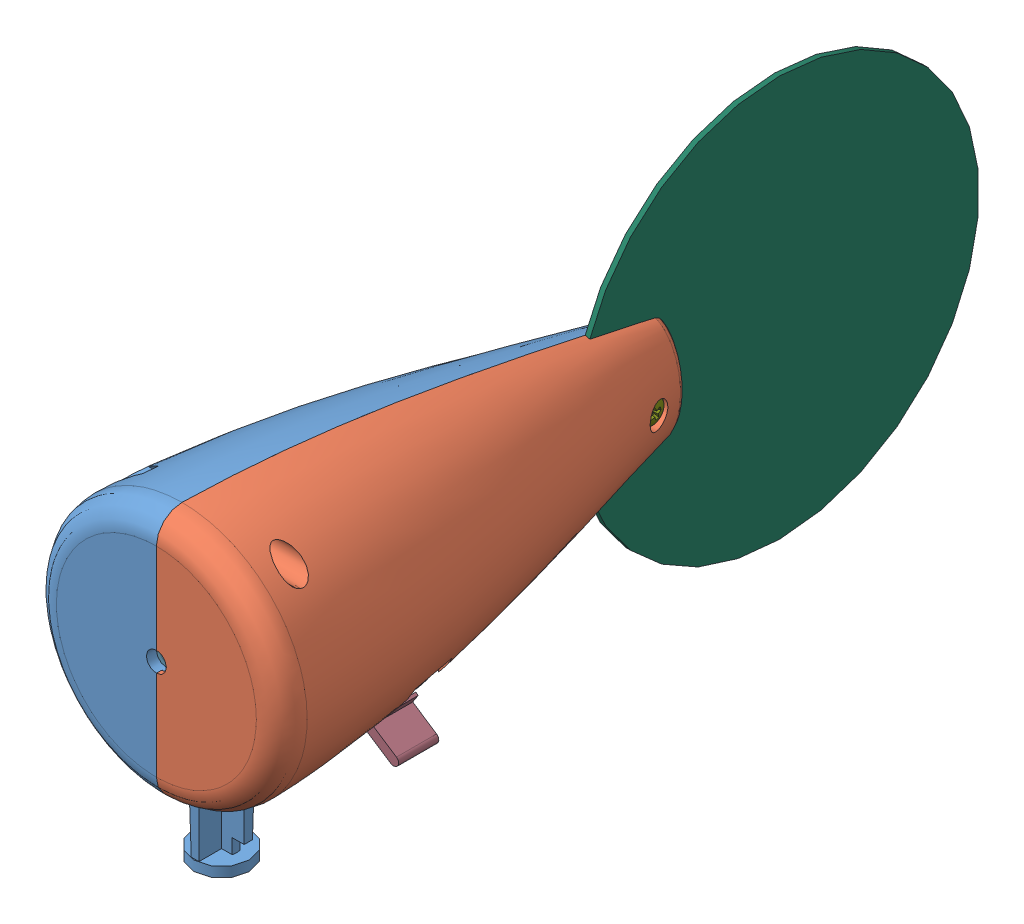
SolidWorks assembly Bloc-Corps.SLDASM, configuration Défaut (file format 4400). Lengths in mm.
Overall size (52.98 80 163.01).
68 component instances, 17 part files, 22 mates.
Components (placement in the parent):
- Carter-gauche-1: Carter-gauche.SLDPRT [Défaut] at origin size (32.84 66.36 100.12)
- Carter-droit-1: Carter-droit.SLDPRT [Défaut] at origin size (28.34 53.31 100.12)
- Circuit-Redresseur-1: Circuit-Redresseur.SLDASM [Défaut] at (0 -9.75 -71.85) x (0 0 1) z (-1 0 0) size (51.6 25.74 31)
  - Circuit-1: Circuit.SLDPRT [Défaut] at origin size (51.6 1.3 29.8)
  - User Library-jst-b3b-xh-a-1: User Library-jst-b3b-xh-a.SLDPRT [Default] at (47.225 1.3 6.95) x (0 0 1) z (-1 0 0) size (9.9 10.4 5.75)
  - User Library-DO-35_300mils-1: User Library-DO-35_300mils.SLDASM [Default] at (30.5184 1.5 -4.9268) x (1 0 0) z (0 1 0) size (8.16 1.92 4.46)
    - User Library-DO-35_300mils_Cylinder001-1: User Library-DO-35_300mils_Cylinder001.sldprt [Default] at origin size (1 0.52 0.52)
    - User Library-DO-35_300mils_Cylinder002-1: User Library-DO-35_300mils_Cylinder002.sldprt [Default] at origin size (1 0.52 0.52)
    - User Library-DO-35_300mils_Torus-1: User Library-DO-35_300mils_Torus.sldprt [Default] at origin size (0.77 0.55 0.77)
    - User Library-DO-35_300mils_Cylinder003-1: User Library-DO-35_300mils_Cylinder003.sldprt [Default] at origin size (0.52 0.52 3)
    - User Library-DO-35_300mils_Cylinder004-1: User Library-DO-35_300mils_Cylinder004.sldprt [Default] at origin size (0.52 0.52 3)
    - User Library-DO-35_300mils_Torus_(Mirror_#1)-1: User Library-DO-35_300mils_Torus_(Mirror_#1).sldprt [Default] at origin size (0.77 0.55 0.77)
    - User Library-DO-35_300mils_Fillet-1: User Library-DO-35_300mils_Fillet.sldprt [Default] at origin size (4.32 1.92 1.92)
    - User Library-DO-35_300mils_Fillet001-1: User Library-DO-35_300mils_Fillet001.sldprt [Default] at origin size (0.7 1.92 1.92)
  - User Library-DO-35_300mils-2: User Library-DO-35_300mils.SLDASM [Default] at (30.5184 1.5 6.821) x (1 0 0) z (0 1 0) size (8.16 1.92 4.46)
    - User Library-DO-35_300mils_Cylinder001-1: User Library-DO-35_300mils_Cylinder001.sldprt [Default] at origin size (1 0.52 0.52)
    - User Library-DO-35_300mils_Cylinder002-1: User Library-DO-35_300mils_Cylinder002.sldprt [Default] at origin size (1 0.52 0.52)
    - User Library-DO-35_300mils_Torus-1: User Library-DO-35_300mils_Torus.sldprt [Default] at origin size (0.77 0.55 0.77)
    - User Library-DO-35_300mils_Cylinder003-1: User Library-DO-35_300mils_Cylinder003.sldprt [Default] at origin size (0.52 0.52 3)
    - User Library-DO-35_300mils_Cylinder004-1: User Library-DO-35_300mils_Cylinder004.sldprt [Default] at origin size (0.52 0.52 3)
    - User Library-DO-35_300mils_Torus_(Mirror_#1)-1: User Library-DO-35_300mils_Torus_(Mirror_#1).sldprt [Default] at origin size (0.77 0.55 0.77)
    - User Library-DO-35_300mils_Fillet-1: User Library-DO-35_300mils_Fillet.sldprt [Default] at origin size (4.32 1.92 1.92)
    - User Library-DO-35_300mils_Fillet001-1: User Library-DO-35_300mils_Fillet001.sldprt [Default] at origin size (0.7 1.92 1.92)
  - User Library-DO-35_300mils-3: User Library-DO-35_300mils.SLDASM [Default] at (30.5184 1.5 9.741) x (1 0 0) z (0 1 0) size (8.16 1.92 4.46)
    - User Library-DO-35_300mils_Cylinder001-1: User Library-DO-35_300mils_Cylinder001.sldprt [Default] at origin size (1 0.52 0.52)
    - User Library-DO-35_300mils_Cylinder002-1: User Library-DO-35_300mils_Cylinder002.sldprt [Default] at origin size (1 0.52 0.52)
    - User Library-DO-35_300mils_Torus-1: User Library-DO-35_300mils_Torus.sldprt [Default] at origin size (0.77 0.55 0.77)
    - User Library-DO-35_300mils_Cylinder003-1: User Library-DO-35_300mils_Cylinder003.sldprt [Default] at origin size (0.52 0.52 3)
    - User Library-DO-35_300mils_Cylinder004-1: User Library-DO-35_300mils_Cylinder004.sldprt [Default] at origin size (0.52 0.52 3)
    - User Library-DO-35_300mils_Torus_(Mirror_#1)-1: User Library-DO-35_300mils_Torus_(Mirror_#1).sldprt [Default] at origin size (0.77 0.55 0.77)
    - User Library-DO-35_300mils_Fillet-1: User Library-DO-35_300mils_Fillet.sldprt [Default] at origin size (4.32 1.92 1.92)
    - User Library-DO-35_300mils_Fillet001-1: User Library-DO-35_300mils_Fillet001.sldprt [Default] at origin size (0.7 1.92 1.92)
  - User Library-DO-35_300mils-4: User Library-DO-35_300mils.SLDASM [Default] at (30.5184 1.5 -7.8468) x (1 0 0) z (0 1 0) size (8.16 1.92 4.46)
    - User Library-DO-35_300mils_Cylinder001-1: User Library-DO-35_300mils_Cylinder001.sldprt [Default] at origin size (1 0.52 0.52)
    - User Library-DO-35_300mils_Cylinder002-1: User Library-DO-35_300mils_Cylinder002.sldprt [Default] at origin size (1 0.52 0.52)
    - User Library-DO-35_300mils_Torus-1: User Library-DO-35_300mils_Torus.sldprt [Default] at origin size (0.77 0.55 0.77)
    - User Library-DO-35_300mils_Cylinder003-1: User Library-DO-35_300mils_Cylinder003.sldprt [Default] at origin size (0.52 0.52 3)
    - User Library-DO-35_300mils_Cylinder004-1: User Library-DO-35_300mils_Cylinder004.sldprt [Default] at origin size (0.52 0.52 3)
    - User Library-DO-35_300mils_Torus_(Mirror_#1)-1: User Library-DO-35_300mils_Torus_(Mirror_#1).sldprt [Default] at origin size (0.77 0.55 0.77)
    - User Library-DO-35_300mils_Fillet-1: User Library-DO-35_300mils_Fillet.sldprt [Default] at origin size (4.32 1.92 1.92)
    - User Library-DO-35_300mils_Fillet001-1: User Library-DO-35_300mils_Fillet001.sldprt [Default] at origin size (0.7 1.92 1.92)
  - User Library-DO-35_300mils-5: User Library-DO-35_300mils.SLDASM [Default] at (30.5184 1.5 -2.0068) x (1 0 0) z (0 1 0) size (8.16 1.92 4.46)
    - User Library-DO-35_300mils_Cylinder001-1: User Library-DO-35_300mils_Cylinder001.sldprt [Default] at origin size (1 0.52 0.52)
    - User Library-DO-35_300mils_Cylinder002-1: User Library-DO-35_300mils_Cylinder002.sldprt [Default] at origin size (1 0.52 0.52)
    - User Library-DO-35_300mils_Torus-1: User Library-DO-35_300mils_Torus.sldprt [Default] at origin size (0.77 0.55 0.77)
    - User Library-DO-35_300mils_Cylinder003-1: User Library-DO-35_300mils_Cylinder003.sldprt [Default] at origin size (0.52 0.52 3)
    - User Library-DO-35_300mils_Cylinder004-1: User Library-DO-35_300mils_Cylinder004.sldprt [Default] at origin size (0.52 0.52 3)
    - User Library-DO-35_300mils_Torus_(Mirror_#1)-1: User Library-DO-35_300mils_Torus_(Mirror_#1).sldprt [Default] at origin size (0.77 0.55 0.77)
    - User Library-DO-35_300mils_Fillet-1: User Library-DO-35_300mils_Fillet.sldprt [Default] at origin size (4.32 1.92 1.92)
    - User Library-DO-35_300mils_Fillet001-1: User Library-DO-35_300mils_Fillet001.sldprt [Default] at origin size (0.7 1.92 1.92)
  - User Library-DO-35_300mils-6: User Library-DO-35_300mils.SLDASM [Default] at (46.0064 1.5 -11.2646) x (0 0 1) z (0 1 0) size (8.16 1.92 4.46)
    - User Library-DO-35_300mils_Cylinder001-1: User Library-DO-35_300mils_Cylinder001.sldprt [Default] at origin size (1 0.52 0.52)
    - User Library-DO-35_300mils_Cylinder002-1: User Library-DO-35_300mils_Cylinder002.sldprt [Default] at origin size (1 0.52 0.52)
    - User Library-DO-35_300mils_Torus-1: User Library-DO-35_300mils_Torus.sldprt [Default] at origin size (0.77 0.55 0.77)
    - User Library-DO-35_300mils_Cylinder003-1: User Library-DO-35_300mils_Cylinder003.sldprt [Default] at origin size (0.52 0.52 3)
    - User Library-DO-35_300mils_Cylinder004-1: User Library-DO-35_300mils_Cylinder004.sldprt [Default] at origin size (0.52 0.52 3)
    - User Library-DO-35_300mils_Torus_(Mirror_#1)-1: User Library-DO-35_300mils_Torus_(Mirror_#1).sldprt [Default] at origin size (0.77 0.55 0.77)
    - User Library-DO-35_300mils_Fillet-1: User Library-DO-35_300mils_Fillet.sldprt [Default] at origin size (4.32 1.92 1.92)
    - User Library-DO-35_300mils_Fillet001-1: User Library-DO-35_300mils_Fillet001.sldprt [Default] at origin size (0.7 1.92 1.92)
  - Cosse-1: Cosse.SLDPRT [Défaut] at (35.0403 0 0) x (0 0 -1) z (-1 0 0) size (31 23.94 11.8)
- Stator-1: Stator.SLDPRT [Défaut] at (0 0 -4.9) size (30 30 13.2)
- Enpennage-1: Enpennage.SLDPRT [Défaut] at (1 0 -123) x (0 0 1) z (-1 0 0) size (80 80 1.1)
- Vis M2.5x10-1: Vis M2.5x10.SLDPRT [B18.6.7M - M2.5 x 0.45 x 10 Type I Cross Recessed PHMS --10N] at (5.1 19 -11) x (-1 0 0) z (0 -0.924225 -0.381849) size (12.07 5 5)
- Vis M2.5x10-2: Vis M2.5x10.SLDPRT [B18.6.7M - M2.5 x 0.45 x 10 Type I Cross Recessed PHMS --10N] at (7.1 0 -92.5) x (-1 0 0) z (0 -0.924225 -0.381849) size (12.07 5 5)
- Vis M2.5x10-3: Vis M2.5x10.SLDPRT [B18.6.7M - M2.5 x 0.45 x 10 Type I Cross Recessed PHMS --10N] at (5.1 -19 -11) x (-1 0 0) z (0 -0.924225 -0.381849) size (12.07 5 5)
- Ecrou M2.5-1: Ecrou M2.5.SLDPRT [B18.2.4.1M - Hex nut, Style 1,  M2.5 x 0.45 --D-N] at (-4 19 -11) x (0 -0.5 0.866025) z (-1 0 0) size (5 5.77 2)
- Ecrou M2.5-2: Ecrou M2.5.SLDPRT [B18.2.4.1M - Hex nut, Style 1,  M2.5 x 0.45 --D-N] at (-4 -19 -11) x (0 -0.464539 0.885553) z (-1 0 0) size (5 5.77 2)
- Ecrou M2.5-3: Ecrou M2.5.SLDPRT [B18.2.4.1M - Hex nut, Style 1,  M2.5 x 0.45 --D-N] at (-1 0 -92.5) x (0 -0.278621 0.960401) z (-1 0 0) size (5 5.77 2)
Mates (geometry in assembly coordinates):
- Coïncidente2: coincident anti-aligned: plane of Carter-gauche-1 through (-26.3426 -8.25 -47.55) normal (0 0 1); plane of Circuit-Redresseur-1/Circuit-1 through (-13.4867 -8.45 -47.55) normal (0 0 -1)
- Coïncidente3: coincident anti-aligned: plane of Carter-gauche-1 through (-26.3426 -9.75 -45.8) normal (0 1 0); plane of Circuit-Redresseur-1/Circuit-1 through (-14.9 -9.75 -21.75) normal (0 -1 0)
- Coïncidente4: coincident anti-aligned: plane of Carter-gauche-1 through (-9.5 -11 -20.5) normal (1 0 0); plane of Circuit-Redresseur-1/Circuit-1 through (-9.5 -8.45 -21.75) normal (-1 0 0)
- Coïncidente5: coincident anti-aligned: plane of Carter-gauche-1 through (-26.3426 -15 -4.9) normal (0 1 0); plane of Stator-1 through (-12.5 -15 -5.9) normal (0 -1 0)
- Coïncidente6: coincident anti-aligned: plane of Carter-gauche-1 through (-15 -8.5 -4.9) normal (1 0 0); plane of Stator-1 through (-15 12.5 -5.9) normal (-1 0 0)
- Coïncidente7: coincident anti-aligned: plane of Carter-gauche-1 through (-26.3426 -8.5 -4.9) normal (0 0 -1); plane of Stator-1 through (0 0 -4.9) normal (0 0 1)
- Coaxiale1: concentric anti-aligned: cylinder of Carter-gauche-1 through (-26.3416 0 -92.5) axis (1 0 0) radius 1.5; cylinder of Enpennage-1 through (1 0 -92.5) axis (-1 0 0) radius 3
- Coïncidente8: coincident anti-aligned: plane of Carter-gauche-1 through (0 25 0) normal (1 0 0); plane of Enpennage-1 through (0 0 -123) normal (-1 0 0)
- Coaxiale2: concentric anti-aligned: cylinder of Carter-droit-1 through (26.6354 19 -11) axis (-1 0 0) radius 2.5; cylinder of Vis M2.5x10-1 through (30.5 19 -11) axis (1 0 0) radius 1.25
- Coaxiale3: concentric anti-aligned: cylinder of Carter-droit-1 through (26.6354 0 -92.5) axis (-1 0 0) radius 2.5; cylinder of Vis M2.5x10-2 through (32.5 0 -92.5) axis (1 0 0) radius 1.25
- Coaxiale4: concentric anti-aligned: cylinder of Carter-droit-1 through (26.6354 -19 -11) axis (-1 0 0) radius 2.5; cylinder of Vis M2.5x10-3 through (30.5 -19 -11) axis (1 0 0) radius 1.25
- Coïncidente9: coincident anti-aligned: plane of Carter-droit-1 through (3 19 -11) normal (1 0 0); plane of Vis M2.5x10-1 through (3 19.4773 -12.1553) normal (-1 0 0)
- Coïncidente10: coincident anti-aligned: plane of Carter-droit-1 through (5 0 -92.5) normal (1 0 0); plane of Vis M2.5x10-2 through (5 0.4773 -93.6553) normal (-1 0 0)
- Coïncidente11: coincident anti-aligned: plane of Carter-droit-1 through (3 -19 -11) normal (1 0 0); plane of Vis M2.5x10-3 through (3 -18.5227 -12.1553) normal (-1 0 0)
- Coaxiale5: concentric anti-aligned: cylinder of Vis M2.5x10-1 through (30.5 19 -11) axis (1 0 0) radius 1.25; cylinder of Ecrou M2.5-1 through (-2 19 -11) axis (-1 0 0) radius 1.025
- Coaxiale6: concentric anti-aligned: cylinder of Vis M2.5x10-3 through (30.5 -19 -11) axis (1 0 0) radius 1.25; cylinder of Ecrou M2.5-2 through (-2 -19 -11) axis (-1 0 0) radius 1.025
- Coaxiale7: concentric anti-aligned: cylinder of Vis M2.5x10-2 through (32.5 0 -92.5) axis (1 0 0) radius 1.25; cylinder of Ecrou M2.5-3 through (1 0 -92.5) axis (-1 0 0) radius 1.025
- Parallèle1: parallel aligned: plane of Carter-gauche-1 through (-26.3416 16.5 -9.5566) normal (0 1 0); plane of Ecrou M2.5-1 through (-2 21.5 -9.5566) normal (0 1 0)
- Coïncidente17: coincident anti-aligned: plane of Carter-gauche-1 through (-2 16.5 -12.4434) normal (-1 0 0); plane of Ecrou M2.5-1 through (-2 21.5 -15.3301) normal (1 0 0)
- Coïncidente18: coincident anti-aligned: plane of Carter-gauche-1 through (-2 -21.5 -12.4434) normal (-1 0 0); plane of Ecrou M2.5-2 through (-2 -16.6773 -15.4278) normal (1 0 0)
- Parallèle2: parallel aligned: plane of Carter-gauche-1 through (-26.3416 -2.0828 -90.5012) normal (0 0.971042 -0.238908); plane of Ecrou M2.5-3 through (1 2.7724 -91.6957) normal (0 0.971042 -0.238908)
- Coïncidente22: coincident anti-aligned: plane of Carter-gauche-1 through (1 -2.0828 -90.5012) normal (-1 0 0); plane of Ecrou M2.5-3 through (1 1.3931 -97.302) normal (1 0 0)
